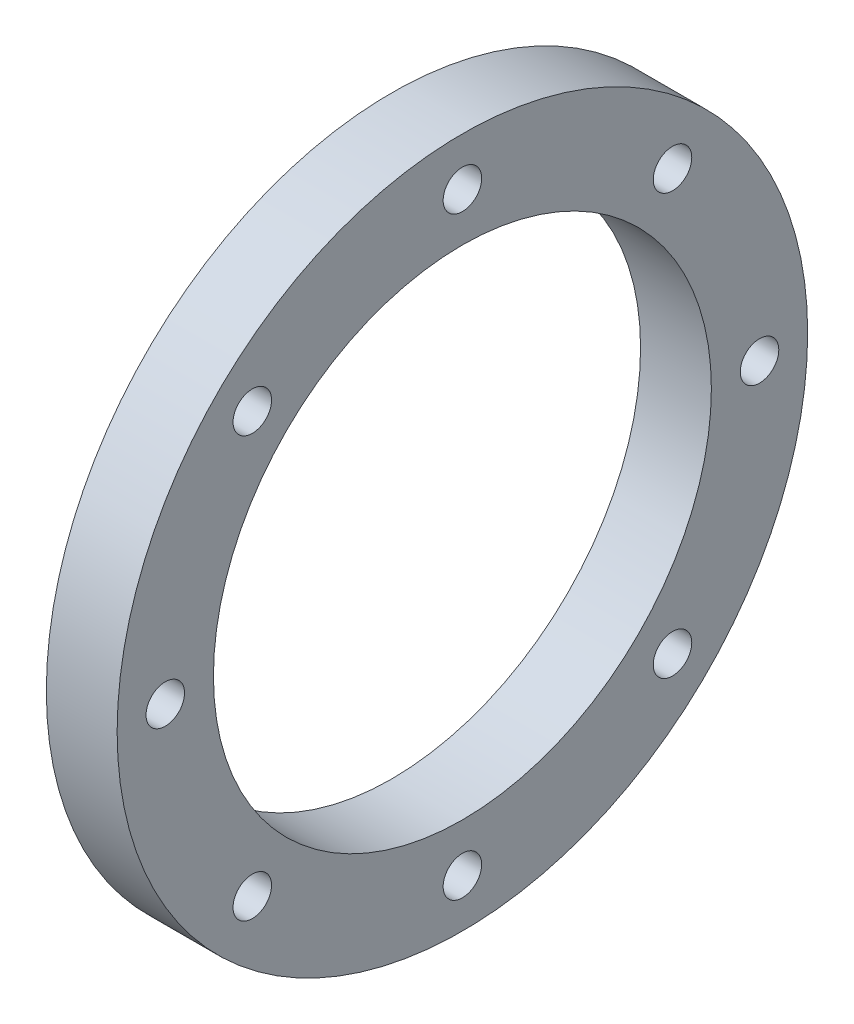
from build123d import *

# Parameters (mm, degrees)
SKETCH1_W             = 6.35
SKETCH1_H             = 8.636
F_8_32_TAPPED_HOLE1_D = 3.4544


with BuildPart() as part:
    # Sketch1 → Revolve1 (revolve)
    with BuildSketch(Plane.XY, mode=Mode.PRIVATE) as revolve1_sk:
        with Locations((-92.075, 26.6446)):
            Rectangle(SKETCH1_W, SKETCH1_H)
    revolve(revolve1_sk.sketch.rotate(Axis((0, 0, 0), (-1, 0, 0)), 90), axis=Axis((0, 0, 0), (-1, 0, 0)))

    # 8-32 Tapped Hole1 (through all)
    with Locations(Plane(origin=(-88.9, 0, 0), x_dir=(0, 0, -1), z_dir=(1, 0, 0))):
        with Locations((-26.6446, 0), (-18.840577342, 18.840577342), (0, 26.6446), (18.840577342, 18.840577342), (26.6446, 0), (18.840577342, -18.840577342), (0, -26.6446), (-18.840577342, -18.840577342)):
            Hole(F_8_32_TAPPED_HOLE1_D / 2)


solid = part.part
